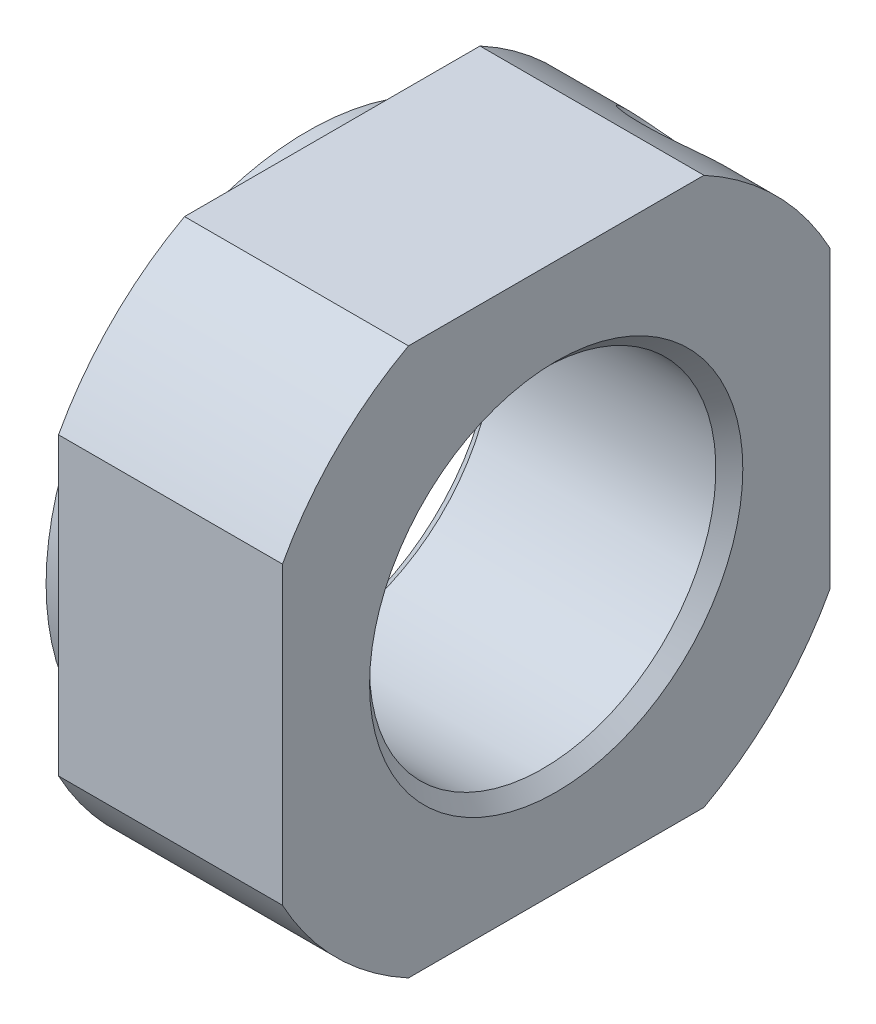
from build123d import *

# Parameters (mm, degrees)
BOSS_EXTRUDE1_DEPTH = 9
SKETCH2_W           = 1
SKETCH2_H           = 10.5


with BuildPart() as part:
    # Sketch1 → Boss-Extrude1 (new body)
    with BuildSketch(Plane(origin=(0, 0, 0), x_dir=(0, 0, -1), z_dir=(1, 0, 0))):
        with BuildLine():
            Line((-5.937171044, -11), (5.937171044, -11))
            ThreePointArc((5.937171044, -11), (8.838834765, -8.838834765), (11, -5.937171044))
            Line((11, -5.937171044), (11, 5.937171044))
            ThreePointArc((11, 5.937171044), (8.838834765, 8.838834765), (5.937171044, 11))
            Line((5.937171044, 11), (-5.937171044, 11))
            ThreePointArc((-5.937171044, 11), (-8.838834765, 8.838834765), (-11, 5.937171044))
            Line((-11, 5.937171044), (-11, -5.937171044))
            ThreePointArc((-11, -5.937171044), (-8.838834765, -8.838834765), (-5.937171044, -11))
        make_face()
    extrude(amount=BOSS_EXTRUDE1_DEPTH)

    # Sketch2 → Revolve1 (revolve)
    with BuildSketch(Plane.XY, mode=Mode.PRIVATE) as revolve1_sk:
        with Locations((-0.5, 5.25)):
            Rectangle(SKETCH2_W, SKETCH2_H)
    revolve(revolve1_sk.sketch.rotate(Axis((0, 0, 0), (-1, 0, 0)), 270), axis=Axis((0, 0, 0), (-1, 0, 0)))

    # Sketch3 → Cut-Revolve1 (revolve, cut)
    with BuildSketch(Plane.XY, mode=Mode.PRIVATE) as cut_revolve1_sk:
        Polygon((-1, 0), (-1, 7.5), (-0.4585, 6.9585), (8.4585, 6.9585), (9, 7.5), (9, 0), align=None)
    revolve(cut_revolve1_sk.sketch.rotate(Axis((9, 0, 0), (-1, 0, 0)), 270), axis=Axis((9, 0, 0), (-1, 0, 0)), mode=Mode.SUBTRACT)

    # Sketch4 → Cut-Revolve2 (revolve, cut)
    with BuildSketch(Plane(origin=(5, 0, 0), x_dir=(0, 0, -1), z_dir=(1, 0, 0)), mode=Mode.PRIVATE) as cut_revolve2_sk:
        Polygon((8.838834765, 8.838834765), (10.253048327, 7.424621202), (9.717061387, 7.424621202), (1.146220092, -1.146220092), (0, 0), align=None)
    revolve(cut_revolve2_sk.sketch.rotate(Axis((5, 0, 0), (0, 0.7071067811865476, -0.7071067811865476)), 180), axis=Axis((5, 0, 0), (0, 0.7071067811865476, -0.7071067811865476)), mode=Mode.SUBTRACT)


solid = part.part
